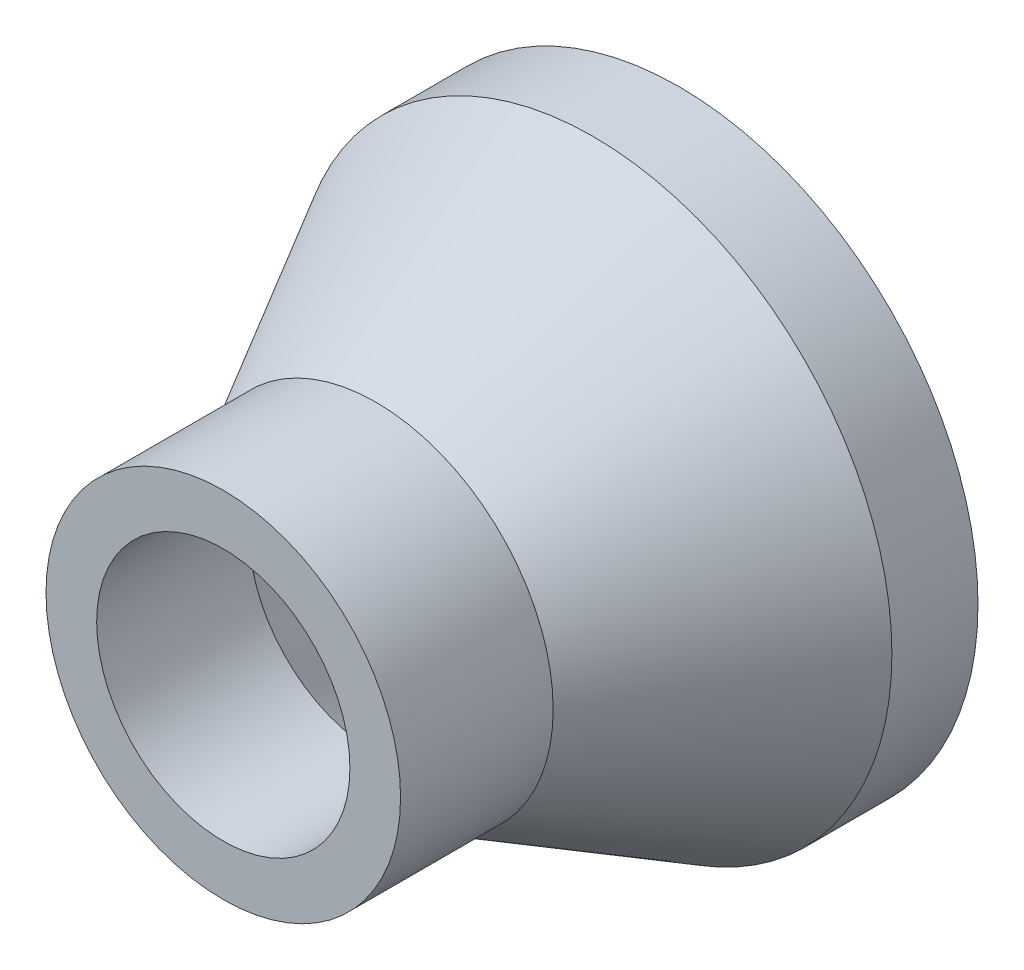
from build123d import *


with BuildPart() as part:
    # Esquisse1 → R_volution1 (revolve)
    with BuildSketch(Plane(origin=(0, 0, 0), x_dir=(0, 0, -1), z_dir=(1, 0, 0)), mode=Mode.PRIVATE) as r_volution1_sk:
        Polygon((-9, 2.5), (-9, 3.5), (-5.987525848, 3.5), (-1.7, 5.9), (0, 5.9), (0, 4.9), (-1.7, 4.9), (-5.987525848, 2.5), align=None)
    revolve(r_volution1_sk.sketch.rotate(Axis((0, 0, -14.963366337), (0, 0, 1)), 90), axis=Axis((0, 0, -14.963366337), (0, 0, 1)))


solid = part.part
